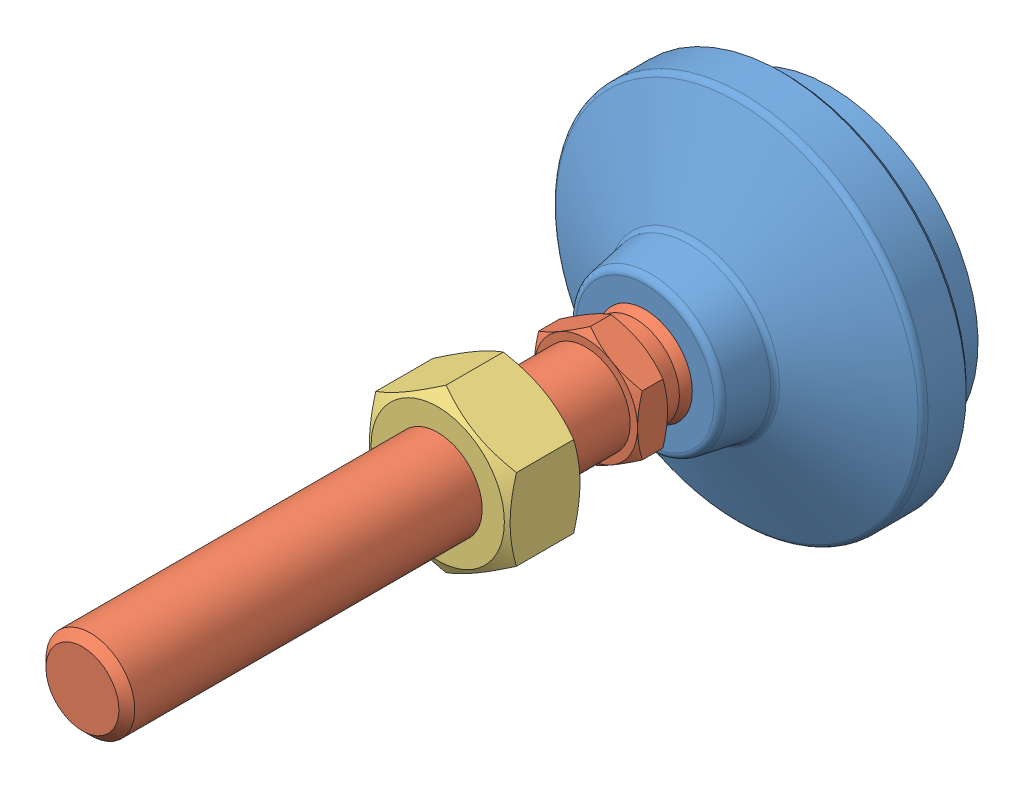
SolidWorks assembly LSVA40-M12X68-SUS.sldasm, configuration Default (file format 15000). Lengths in mm.
Overall size (50 50 101).
3 component instances, 3 part files, 0 mates.
Components (placement in the parent):
- LSVA40-M12X68-SUS_01-1: LSVA40-M12X68-SUS_01.sldprt [Default] at (0 0 6) x (1 0 0) z (0 -1 0) size (50 25 50)
- LSVA40-M12X68-SUS_02-1: LSVA40-M12X68-SUS_02.sldprt [Default] at (0 0 22.15) x (1 0 0) z (0 -1 0) size (14 85.85 16.17)
- LSVA40-M12X68-SUS_03-1: LSVA40-M12X68-SUS_03.sldprt [Default] at (0 0 43) size (19 21.94 10)
